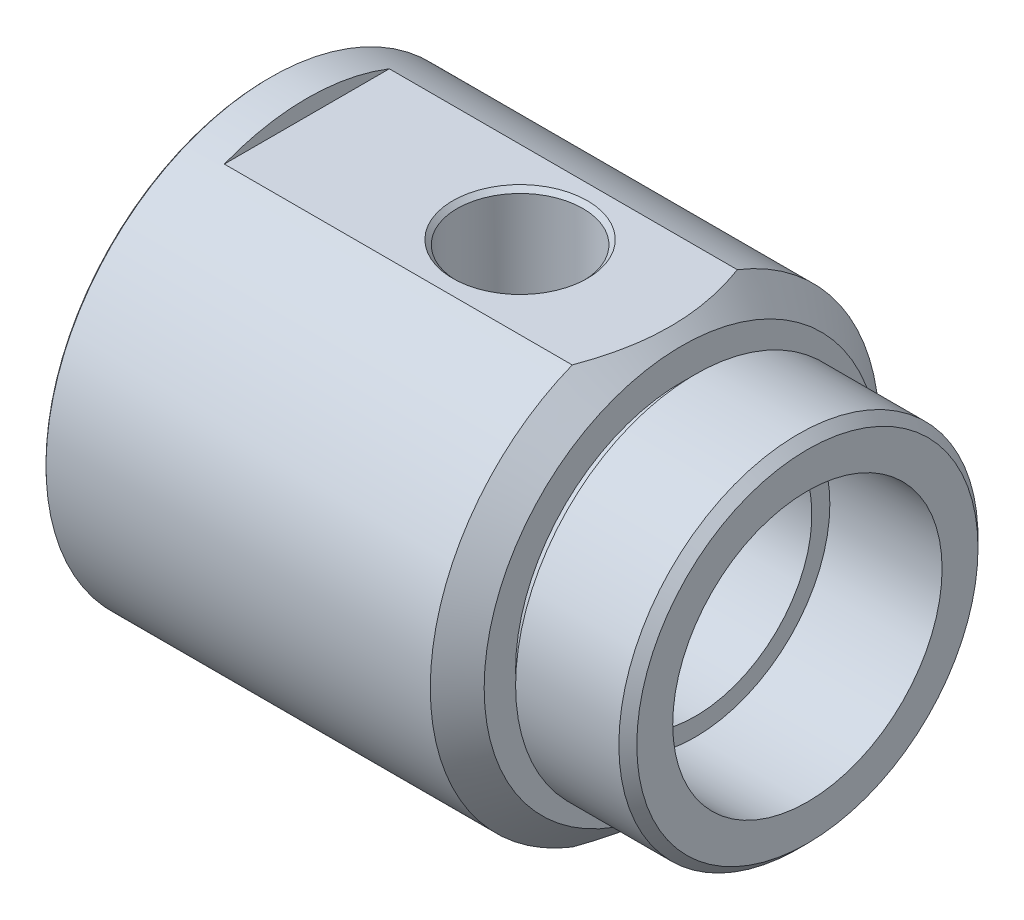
ISO-10303-21;
HEADER;
FILE_DESCRIPTION(('STEP AP214'),'2;1');
FILE_NAME('part.step','',(''),(''),'','','');
FILE_SCHEMA(('AUTOMOTIVE_DESIGN { 1 0 10303 214 1 1 1 1 }'));
ENDSEC;
DATA;
#1=APPLICATION_CONTEXT('core data for automotive mechanical design processes');
#2=APPLICATION_PROTOCOL_DEFINITION('international standard','automotive_design',2000,#1);
#3=PRODUCT_CONTEXT('',#1,'mechanical');
#4=PRODUCT('Part','Part','',(#3));
#5=PRODUCT_RELATED_PRODUCT_CATEGORY('part','',(#4));
#6=PRODUCT_DEFINITION_FORMATION('','',#4);
#7=PRODUCT_DEFINITION_CONTEXT('part definition',#1,'design');
#8=PRODUCT_DEFINITION('design','',#6,#7);
#9=PRODUCT_DEFINITION_SHAPE('','',#8);
#10=(LENGTH_UNIT() NAMED_UNIT(*) SI_UNIT(.MILLI.,.METRE.));
#11=(NAMED_UNIT(*) PLANE_ANGLE_UNIT() SI_UNIT($,.RADIAN.));
#12=(NAMED_UNIT(*) SI_UNIT($,.STERADIAN.) SOLID_ANGLE_UNIT());
#13=UNCERTAINTY_MEASURE_WITH_UNIT(LENGTH_MEASURE(1.E-05),#10,'distance_accuracy_value','');
#14=(GEOMETRIC_REPRESENTATION_CONTEXT(3) GLOBAL_UNCERTAINTY_ASSIGNED_CONTEXT((#13)) GLOBAL_UNIT_ASSIGNED_CONTEXT((#10,
#11,#12)) REPRESENTATION_CONTEXT('',''));
#15=CARTESIAN_POINT('',(0.,0.,0.));
#16=DIRECTION('',(0.,0.,1.));
#17=DIRECTION('',(1.,0.,0.));
#18=AXIS2_PLACEMENT_3D('',#15,#16,#17);
#19=CARTESIAN_POINT('',(0.,0.,0.));
#20=DIRECTION('',(-1.,0.,0.));
#21=DIRECTION('',(0.,0.,1.));
#22=AXIS2_PLACEMENT_3D('',#19,#20,#21);
#23=CYLINDRICAL_SURFACE('',#22,25.);
#24=CARTESIAN_POINT('',(0.199999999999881,0.,0.));
#25=DIRECTION('',(1.,0.,0.));
#26=DIRECTION('',(0.,0.,-1.));
#27=AXIS2_PLACEMENT_3D('',#24,#25,#26);
#28=CIRCLE('',#27,25.);
#29=CARTESIAN_POINT('',(0.199999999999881,0.,-25.));
#30=VERTEX_POINT('',#29);
#31=EDGE_CURVE('E45',#30,#30,#28,.T.);
#32=ORIENTED_EDGE('',*,*,#31,.T.);
#33=EDGE_LOOP('',(#32));
#34=FACE_BOUND('',#33,.T.);
#35=DIRECTION('',(-1.,0.,0.));
#36=VECTOR('',#35,1.);
#37=CARTESIAN_POINT('',(0.,-23.25,9.18898797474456));
#38=LINE('',#37,#36);
#39=CARTESIAN_POINT('',(42.9999999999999,-23.25,9.18898797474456));
#40=VERTEX_POINT('',#39);
#41=CARTESIAN_POINT('',(4.25,-23.25,9.18898797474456));
#42=VERTEX_POINT('',#41);
#43=EDGE_CURVE('E205',#40,#42,#38,.T.);
#44=ORIENTED_EDGE('',*,*,#43,.F.);
#45=CARTESIAN_POINT('',(42.9999999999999,0.,0.));
#46=DIRECTION('',(-1.,0.,0.));
#47=DIRECTION('',(0.,0.,1.));
#48=AXIS2_PLACEMENT_3D('',#45,#46,#47);
#49=CIRCLE('',#48,25.);
#50=CARTESIAN_POINT('',(42.9999999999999,23.25,9.18898797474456));
#51=VERTEX_POINT('',#50);
#52=EDGE_CURVE('E60',#40,#51,#49,.T.);
#53=ORIENTED_EDGE('',*,*,#52,.T.);
#54=DIRECTION('',(-1.,0.,0.));
#55=VECTOR('',#54,1.);
#56=CARTESIAN_POINT('',(0.,23.25,9.18898797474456));
#57=LINE('',#56,#55);
#58=CARTESIAN_POINT('',(4.25,23.25,9.18898797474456));
#59=VERTEX_POINT('',#58);
#60=EDGE_CURVE('E335',#51,#59,#57,.T.);
#61=ORIENTED_EDGE('',*,*,#60,.T.);
#62=CARTESIAN_POINT('',(4.25000000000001,0.,0.));
#63=DIRECTION('',(-1.,0.,0.));
#64=DIRECTION('',(0.,-1.,0.));
#65=AXIS2_PLACEMENT_3D('',#62,#63,#64);
#66=CIRCLE('',#65,25.);
#67=CARTESIAN_POINT('',(4.25,23.25,-9.18898797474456));
#68=VERTEX_POINT('',#67);
#69=EDGE_CURVE('E164',#59,#68,#66,.T.);
#70=ORIENTED_EDGE('',*,*,#69,.T.);
#71=DIRECTION('',(-1.,0.,0.));
#72=VECTOR('',#71,1.);
#73=CARTESIAN_POINT('',(0.,23.25,-9.18898797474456));
#74=LINE('',#73,#72);
#75=CARTESIAN_POINT('',(42.9999999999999,23.25,-9.18898797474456));
#76=VERTEX_POINT('',#75);
#77=EDGE_CURVE('E333',#68,#76,#74,.F.);
#78=ORIENTED_EDGE('',*,*,#77,.T.);
#79=CARTESIAN_POINT('',(42.9999999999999,-23.25,-9.18898797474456));
#80=VERTEX_POINT('',#79);
#81=EDGE_CURVE('E213',#76,#80,#49,.T.);
#82=ORIENTED_EDGE('',*,*,#81,.T.);
#83=DIRECTION('',(-1.,0.,0.));
#84=VECTOR('',#83,1.);
#85=CARTESIAN_POINT('',(0.,-23.25,-9.18898797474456));
#86=LINE('',#85,#84);
#87=CARTESIAN_POINT('',(4.25,-23.25,-9.18898797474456));
#88=VERTEX_POINT('',#87);
#89=EDGE_CURVE('E52',#88,#80,#86,.F.);
#90=ORIENTED_EDGE('',*,*,#89,.F.);
#91=CARTESIAN_POINT('',(4.25000000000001,0.,0.));
#92=DIRECTION('',(1.,0.,0.));
#93=DIRECTION('',(0.,1.,0.));
#94=AXIS2_PLACEMENT_3D('',#91,#92,#93);
#95=CIRCLE('',#94,25.);
#96=EDGE_CURVE('E163',#42,#88,#95,.T.);
#97=ORIENTED_EDGE('',*,*,#96,.F.);
#98=EDGE_LOOP('',(#44,#53,#61,#70,#78,#82,#90,#97));
#99=FACE_BOUND('',#98,.T.);
#100=ADVANCED_FACE('F38',(#34,#99),#23,.T.);
#101=CARTESIAN_POINT('',(42.9999999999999,0.,0.));
#102=DIRECTION('',(-1.,0.,0.));
#103=DIRECTION('',(0.,0.,1.));
#104=AXIS2_PLACEMENT_3D('',#101,#102,#103);
#105=CONICAL_SURFACE('',#104,25.,0.785398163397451);
#106=CARTESIAN_POINT('',(45.9999999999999,0.,0.));
#107=DIRECTION('',(-1.,0.,0.));
#108=DIRECTION('',(0.,0.,1.));
#109=AXIS2_PLACEMENT_3D('',#106,#107,#108);
#110=CIRCLE('',#109,22.);
#111=CARTESIAN_POINT('',(45.9999999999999,0.,22.));
#112=VERTEX_POINT('',#111);
#113=EDGE_CURVE('E216',#112,#112,#110,.F.);
#114=ORIENTED_EDGE('',*,*,#113,.F.);
#115=EDGE_LOOP('',(#114));
#116=FACE_BOUND('',#115,.T.);
#117=ORIENTED_EDGE('',*,*,#52,.F.);
#118=CARTESIAN_POINT('',(39.1715018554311,-23.25,-17.0446415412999));
#119=CARTESIAN_POINT('',(39.4225471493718,-23.25,-16.6199759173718));
#120=CARTESIAN_POINT('',(39.6691360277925,-23.25,-16.1926410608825));
#121=CARTESIAN_POINT('',(40.1520597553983,-23.25,-15.3320800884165));
#122=CARTESIAN_POINT('',(40.388391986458,-23.25,-14.898852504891));
#123=CARTESIAN_POINT('',(40.8502765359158,-23.25,-14.0243808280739));
#124=CARTESIAN_POINT('',(41.0757807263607,-23.25,-13.5831111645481));
#125=CARTESIAN_POINT('',(41.5132168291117,-23.25,-12.6939735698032));
#126=CARTESIAN_POINT('',(41.7251496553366,-23.25,-12.2461060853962));
#127=CARTESIAN_POINT('',(42.3449482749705,-23.25,-10.8761496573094));
#128=CARTESIAN_POINT('',(42.7287080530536,-23.25,-9.94276379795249));
#129=CARTESIAN_POINT('',(43.241660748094,-23.25,-8.5210051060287));
#130=CARTESIAN_POINT('',(43.4021101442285,-23.25,-8.04380089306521));
#131=CARTESIAN_POINT('',(43.6995767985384,-23.25,-7.08217080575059));
#132=CARTESIAN_POINT('',(43.8365978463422,-23.25,-6.59774611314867));
#133=CARTESIAN_POINT('',(44.1076801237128,-23.25,-5.5311491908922));
#134=CARTESIAN_POINT('',(44.2364169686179,-23.25,-4.94760636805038));
#135=CARTESIAN_POINT('',(44.4529427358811,-23.25,-3.77286868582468));
#136=CARTESIAN_POINT('',(44.5407296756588,-23.25,-3.1816734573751));
#137=CARTESIAN_POINT('',(44.6715120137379,-23.25,-1.99948035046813));
#138=CARTESIAN_POINT('',(44.7148879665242,-23.25,-1.4085249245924));
#139=CARTESIAN_POINT('',(44.7564302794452,-23.25,-0.224945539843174));
#140=CARTESIAN_POINT('',(44.7545956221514,-23.25,0.367678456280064));
#141=CARTESIAN_POINT('',(44.7160862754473,-23.25,1.30226166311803));
#142=CARTESIAN_POINT('',(44.6943760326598,-23.25,1.64490684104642));
#143=CARTESIAN_POINT('',(44.636132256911,-23.25,2.32893972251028));
#144=CARTESIAN_POINT('',(44.5995983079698,-23.25,2.67032739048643));
#145=CARTESIAN_POINT('',(44.4683973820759,-23.25,3.69177756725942));
#146=CARTESIAN_POINT('',(44.3521299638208,-23.25,4.36915863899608));
#147=CARTESIAN_POINT('',(44.0656926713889,-23.25,5.7211183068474));
#148=CARTESIAN_POINT('',(43.8948615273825,-23.25,6.39555383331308));
#149=CARTESIAN_POINT('',(43.5067897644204,-23.25,7.73064512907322));
#150=CARTESIAN_POINT('',(43.2895581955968,-23.25,8.39130355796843));
#151=CARTESIAN_POINT('',(42.7563639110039,-23.25,9.86200763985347));
#152=CARTESIAN_POINT('',(42.4293011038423,-23.25,10.668005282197));
#153=CARTESIAN_POINT('',(41.7260058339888,-23.25,12.2584466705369));
#154=CARTESIAN_POINT('',(41.3497479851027,-23.25,13.0428790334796));
#155=CARTESIAN_POINT('',(40.5570739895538,-23.25,14.5944492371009));
#156=CARTESIAN_POINT('',(40.1405234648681,-23.25,15.3615178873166));
#157=CARTESIAN_POINT('',(39.2765895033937,-23.25,16.8777920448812));
#158=CARTESIAN_POINT('',(38.8292114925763,-23.25,17.627000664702));
#159=CARTESIAN_POINT('',(37.9307971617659,-23.25,19.0762321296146));
#160=CARTESIAN_POINT('',(37.4808592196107,-23.25,19.776939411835));
#161=CARTESIAN_POINT('',(36.562704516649,-23.25,21.1663139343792));
#162=CARTESIAN_POINT('',(36.0944862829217,-23.25,21.8549801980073));
#163=CARTESIAN_POINT('',(35.1471080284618,-23.25,23.2160872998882));
#164=CARTESIAN_POINT('',(34.6680741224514,-23.25,23.8886161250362));
#165=CARTESIAN_POINT('',(33.9404318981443,-23.25,24.8906464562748));
#166=CARTESIAN_POINT('',(33.6964014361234,-23.25,25.2234867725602));
#167=CARTESIAN_POINT('',(33.2055447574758,-23.25,25.8870898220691));
#168=CARTESIAN_POINT('',(32.9587185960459,-23.25,26.2178525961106));
#169=CARTESIAN_POINT('',(32.7106167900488,-23.25,26.5476565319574));
#170=B_SPLINE_CURVE_WITH_KNOTS('',3,(#118,#119,#120,#121,#122,#123,#124,#125,#126,#127,#128,
#129,#130,#131,#132,#133,#134,#135,#136,#137,#138,#139,#140,#141,#142,#143,#144,#145,#146,#147,
#148,#149,#150,#151,#152,#153,#154,#155,#156,#157,#158,#159,#160,#161,#162,#163,#164,#165,#166,
#167,#168,#169),.UNSPECIFIED.,.F.,.F.,(4,2,2,2,2,2,2,2,2,2,2,2,2,2,2,2,2,2,2,2,2,2,2,2,2,4),(0.,
1.47997369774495,2.96032297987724,4.44673675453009,5.93305032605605,8.95689539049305,
10.4667855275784,11.9764312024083,13.7678066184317,15.5592687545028,17.3352481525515,
19.1112675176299,20.1409682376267,21.1706978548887,23.2300631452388,25.3153989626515,
27.4003284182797,30.00768224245,32.6163868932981,35.23411312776,37.8513797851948,
40.3492226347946,42.8472671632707,45.3241734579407,46.5623061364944,47.8004144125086),.UNSPECIFIED.);
#171=EDGE_CURVE('E156',#40,#80,#170,.F.);
#172=ORIENTED_EDGE('',*,*,#171,.T.);
#173=ORIENTED_EDGE('',*,*,#81,.F.);
#174=CARTESIAN_POINT('',(39.1715018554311,23.25,-17.0446415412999));
#175=CARTESIAN_POINT('',(39.4225471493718,23.25,-16.6199759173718));
#176=CARTESIAN_POINT('',(39.6691360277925,23.25,-16.1926410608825));
#177=CARTESIAN_POINT('',(40.1520597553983,23.25,-15.3320800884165));
#178=CARTESIAN_POINT('',(40.388391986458,23.25,-14.898852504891));
#179=CARTESIAN_POINT('',(40.8502765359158,23.25,-14.0243808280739));
#180=CARTESIAN_POINT('',(41.0757807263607,23.25,-13.5831111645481));
#181=CARTESIAN_POINT('',(41.5132168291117,23.25,-12.6939735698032));
#182=CARTESIAN_POINT('',(41.7251496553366,23.25,-12.2461060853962));
#183=CARTESIAN_POINT('',(42.3449482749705,23.25,-10.8761496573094));
#184=CARTESIAN_POINT('',(42.7287080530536,23.25,-9.94276379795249));
#185=CARTESIAN_POINT('',(43.241660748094,23.25,-8.5210051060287));
#186=CARTESIAN_POINT('',(43.4021101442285,23.25,-8.04380089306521));
#187=CARTESIAN_POINT('',(43.6995767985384,23.25,-7.08217080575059));
#188=CARTESIAN_POINT('',(43.8365978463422,23.25,-6.59774611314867));
#189=CARTESIAN_POINT('',(44.1076801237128,23.25,-5.5311491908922));
#190=CARTESIAN_POINT('',(44.2364169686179,23.25,-4.94760636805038));
#191=CARTESIAN_POINT('',(44.4529427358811,23.25,-3.77286868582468));
#192=CARTESIAN_POINT('',(44.5407296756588,23.25,-3.1816734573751));
#193=CARTESIAN_POINT('',(44.6715120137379,23.25,-1.99948035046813));
#194=CARTESIAN_POINT('',(44.7148879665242,23.25,-1.4085249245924));
#195=CARTESIAN_POINT('',(44.7564302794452,23.25,-0.224945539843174));
#196=CARTESIAN_POINT('',(44.7545956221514,23.25,0.367678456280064));
#197=CARTESIAN_POINT('',(44.7160862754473,23.25,1.30226166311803));
#198=CARTESIAN_POINT('',(44.6943760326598,23.25,1.64490684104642));
#199=CARTESIAN_POINT('',(44.636132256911,23.25,2.32893972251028));
#200=CARTESIAN_POINT('',(44.5995983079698,23.25,2.67032739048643));
#201=CARTESIAN_POINT('',(44.4683973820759,23.25,3.69177756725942));
#202=CARTESIAN_POINT('',(44.3521299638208,23.25,4.36915863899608));
#203=CARTESIAN_POINT('',(44.0656926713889,23.25,5.7211183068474));
#204=CARTESIAN_POINT('',(43.8948615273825,23.25,6.39555383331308));
#205=CARTESIAN_POINT('',(43.5067897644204,23.25,7.73064512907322));
#206=CARTESIAN_POINT('',(43.2895581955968,23.25,8.39130355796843));
#207=CARTESIAN_POINT('',(42.7563639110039,23.25,9.86200763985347));
#208=CARTESIAN_POINT('',(42.4293011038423,23.25,10.668005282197));
#209=CARTESIAN_POINT('',(41.7260058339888,23.25,12.2584466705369));
#210=CARTESIAN_POINT('',(41.3497479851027,23.25,13.0428790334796));
#211=CARTESIAN_POINT('',(40.5570739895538,23.25,14.5944492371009));
#212=CARTESIAN_POINT('',(40.1405234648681,23.25,15.3615178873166));
#213=CARTESIAN_POINT('',(39.2765895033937,23.25,16.8777920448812));
#214=CARTESIAN_POINT('',(38.8292114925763,23.25,17.627000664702));
#215=CARTESIAN_POINT('',(37.9307971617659,23.25,19.0762321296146));
#216=CARTESIAN_POINT('',(37.4808592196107,23.25,19.776939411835));
#217=CARTESIAN_POINT('',(36.562704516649,23.25,21.1663139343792));
#218=CARTESIAN_POINT('',(36.0944862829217,23.25,21.8549801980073));
#219=CARTESIAN_POINT('',(35.1471080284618,23.25,23.2160872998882));
#220=CARTESIAN_POINT('',(34.6680741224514,23.25,23.8886161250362));
#221=CARTESIAN_POINT('',(33.9404318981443,23.25,24.8906464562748));
#222=CARTESIAN_POINT('',(33.6964014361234,23.25,25.2234867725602));
#223=CARTESIAN_POINT('',(33.2055447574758,23.25,25.8870898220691));
#224=CARTESIAN_POINT('',(32.9587185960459,23.25,26.2178525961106));
#225=CARTESIAN_POINT('',(32.7106167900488,23.25,26.5476565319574));
#226=B_SPLINE_CURVE_WITH_KNOTS('',3,(#174,#175,#176,#177,#178,#179,#180,#181,#182,#183,#184,
#185,#186,#187,#188,#189,#190,#191,#192,#193,#194,#195,#196,#197,#198,#199,#200,#201,#202,#203,
#204,#205,#206,#207,#208,#209,#210,#211,#212,#213,#214,#215,#216,#217,#218,#219,#220,#221,#222,
#223,#224,#225),.UNSPECIFIED.,.F.,.F.,(4,2,2,2,2,2,2,2,2,2,2,2,2,2,2,2,2,2,2,2,2,2,2,2,2,4),(0.,
1.47997369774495,2.96032297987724,4.44673675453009,5.93305032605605,8.95689539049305,
10.4667855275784,11.9764312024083,13.7678066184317,15.5592687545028,17.3352481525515,
19.1112675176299,20.1409682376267,21.1706978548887,23.2300631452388,25.3153989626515,
27.4003284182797,30.00768224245,32.6163868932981,35.23411312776,37.8513797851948,
40.3492226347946,42.8472671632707,45.3241734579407,46.5623061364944,47.8004144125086),.UNSPECIFIED.);
#227=EDGE_CURVE('E179',#51,#76,#226,.F.);
#228=ORIENTED_EDGE('',*,*,#227,.F.);
#229=EDGE_LOOP('',(#117,#172,#173,#228));
#230=FACE_BOUND('',#229,.T.);
#231=ADVANCED_FACE('F167',(#116,#230),#105,.T.);
#232=CARTESIAN_POINT('',(0.,14.5,0.));
#233=DIRECTION('',(1.,0.,0.));
#234=DIRECTION('',(0.,0.,-1.));
#235=AXIS2_PLACEMENT_3D('',#232,#233,#234);
#236=PLANE('',#235);
#237=CARTESIAN_POINT('',(0.,15.2027957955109,15.2027957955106));
#238=DIRECTION('',(-1.,0.,0.));
#239=DIRECTION('',(0.,0.,1.));
#240=AXIS2_PLACEMENT_3D('',#237,#238,#239);
#241=CIRCLE('',#240,1.64999999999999);
#242=CARTESIAN_POINT('',(0.,15.2027957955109,16.8527957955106));
#243=VERTEX_POINT('',#242);
#244=EDGE_CURVE('E100',#243,#243,#241,.T.);
#245=ORIENTED_EDGE('',*,*,#244,.F.);
#246=EDGE_LOOP('',(#245));
#247=FACE_BOUND('',#246,.T.);
#248=CARTESIAN_POINT('',(0.,-15.2027957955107,15.2027957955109));
#249=DIRECTION('',(-1.,0.,0.));
#250=DIRECTION('',(0.,0.,1.));
#251=AXIS2_PLACEMENT_3D('',#248,#249,#250);
#252=CIRCLE('',#251,1.64999999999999);
#253=CARTESIAN_POINT('',(0.,-15.2027957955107,16.8527957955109));
#254=VERTEX_POINT('',#253);
#255=EDGE_CURVE('E108',#254,#254,#252,.T.);
#256=ORIENTED_EDGE('',*,*,#255,.F.);
#257=EDGE_LOOP('',(#256));
#258=FACE_BOUND('',#257,.T.);
#259=CARTESIAN_POINT('',(0.,-15.2027957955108,-15.2027957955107));
#260=DIRECTION('',(-1.,0.,0.));
#261=DIRECTION('',(0.,0.,1.));
#262=AXIS2_PLACEMENT_3D('',#259,#260,#261);
#263=CIRCLE('',#262,1.64999999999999);
#264=CARTESIAN_POINT('',(0.,-15.2027957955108,-13.5527957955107));
#265=VERTEX_POINT('',#264);
#266=EDGE_CURVE('E114',#265,#265,#263,.T.);
#267=ORIENTED_EDGE('',*,*,#266,.F.);
#268=EDGE_LOOP('',(#267));
#269=FACE_BOUND('',#268,.T.);
#270=CARTESIAN_POINT('',(0.,15.2027957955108,-15.2027957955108));
#271=DIRECTION('',(-1.,0.,0.));
#272=DIRECTION('',(0.,0.,1.));
#273=AXIS2_PLACEMENT_3D('',#270,#271,#272);
#274=CIRCLE('',#273,1.64999999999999);
#275=CARTESIAN_POINT('',(0.,15.2027957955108,-13.5527957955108));
#276=VERTEX_POINT('',#275);
#277=EDGE_CURVE('E120',#276,#276,#274,.T.);
#278=ORIENTED_EDGE('',*,*,#277,.F.);
#279=EDGE_LOOP('',(#278));
#280=FACE_BOUND('',#279,.T.);
#281=CARTESIAN_POINT('',(0.,0.,0.));
#282=DIRECTION('',(1.,0.,0.));
#283=DIRECTION('',(0.,0.,-1.));
#284=AXIS2_PLACEMENT_3D('',#281,#282,#283);
#285=CIRCLE('',#284,24.8000000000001);
#286=CARTESIAN_POINT('',(0.,0.,-24.8000000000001));
#287=VERTEX_POINT('',#286);
#288=EDGE_CURVE('E314',#287,#287,#285,.F.);
#289=ORIENTED_EDGE('',*,*,#288,.T.);
#290=EDGE_LOOP('',(#289));
#291=FACE_BOUND('',#290,.T.);
#292=CARTESIAN_POINT('',(0.,0.,0.));
#293=DIRECTION('',(1.,0.,0.));
#294=DIRECTION('',(0.,0.,-1.));
#295=AXIS2_PLACEMENT_3D('',#292,#293,#294);
#296=CIRCLE('',#295,14.7000000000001);
#297=CARTESIAN_POINT('',(0.,0.,-14.7000000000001));
#298=VERTEX_POINT('',#297);
#299=EDGE_CURVE('E306',#298,#298,#296,.T.);
#300=ORIENTED_EDGE('',*,*,#299,.T.);
#301=EDGE_LOOP('',(#300));
#302=FACE_BOUND('',#301,.T.);
#303=ADVANCED_FACE('F172',(#247,#258,#269,#280,#291,#302),#236,.F.);
#304=CARTESIAN_POINT('',(0.,0.,0.));
#305=DIRECTION('',(-1.,0.,0.));
#306=DIRECTION('',(0.,0.,1.));
#307=AXIS2_PLACEMENT_3D('',#304,#305,#306);
#308=CYLINDRICAL_SURFACE('',#307,14.5);
#309=CARTESIAN_POINT('',(0.199999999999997,0.,0.));
#310=DIRECTION('',(1.,0.,0.));
#311=DIRECTION('',(0.,0.,-1.));
#312=AXIS2_PLACEMENT_3D('',#309,#310,#311);
#313=CIRCLE('',#312,14.5);
#314=CARTESIAN_POINT('',(0.199999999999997,0.,-14.5));
#315=VERTEX_POINT('',#314);
#316=EDGE_CURVE('E11',#315,#315,#313,.F.);
#317=ORIENTED_EDGE('',*,*,#316,.T.);
#318=EDGE_LOOP('',(#317));
#319=FACE_BOUND('',#318,.T.);
#320=CARTESIAN_POINT('',(4.25,0.,0.));
#321=DIRECTION('',(-1.,0.,0.));
#322=DIRECTION('',(0.,0.,1.));
#323=AXIS2_PLACEMENT_3D('',#320,#321,#322);
#324=CIRCLE('',#323,14.5);
#325=CARTESIAN_POINT('',(4.25,0.,14.5));
#326=VERTEX_POINT('',#325);
#327=EDGE_CURVE('E214',#326,#326,#324,.T.);
#328=ORIENTED_EDGE('',*,*,#327,.F.);
#329=EDGE_LOOP('',(#328));
#330=FACE_BOUND('',#329,.T.);
#331=ADVANCED_FACE('F261',(#319,#330),#308,.F.);
#332=CARTESIAN_POINT('',(4.25,13.,0.));
#333=DIRECTION('',(1.,0.,0.));
#334=DIRECTION('',(0.,0.,-1.));
#335=AXIS2_PLACEMENT_3D('',#332,#333,#334);
#336=PLANE('',#335);
#337=CARTESIAN_POINT('',(4.25,0.,0.));
#338=DIRECTION('',(-1.,0.,0.));
#339=DIRECTION('',(0.,0.,1.));
#340=AXIS2_PLACEMENT_3D('',#337,#338,#339);
#341=CIRCLE('',#340,13.);
#342=CARTESIAN_POINT('',(4.25,0.,13.));
#343=VERTEX_POINT('',#342);
#344=EDGE_CURVE('E218',#343,#343,#341,.T.);
#345=ORIENTED_EDGE('',*,*,#344,.F.);
#346=EDGE_LOOP('',(#345));
#347=FACE_BOUND('',#346,.T.);
#348=ORIENTED_EDGE('',*,*,#327,.T.);
#349=EDGE_LOOP('',(#348));
#350=FACE_BOUND('',#349,.T.);
#351=ADVANCED_FACE('F258',(#347,#350),#336,.F.);
#352=CARTESIAN_POINT('',(0.,0.,0.));
#353=DIRECTION('',(-1.,0.,0.));
#354=DIRECTION('',(0.,0.,1.));
#355=AXIS2_PLACEMENT_3D('',#352,#353,#354);
#356=CYLINDRICAL_SURFACE('',#355,13.);
#357=CARTESIAN_POINT('',(28.,-10.9544511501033,7.));
#358=CARTESIAN_POINT('',(27.8198205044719,-10.9544497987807,7.00000106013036));
#359=CARTESIAN_POINT('',(27.6396530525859,-10.9589111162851,6.99303487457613));
#360=CARTESIAN_POINT('',(27.2807531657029,-10.9765743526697,6.96527724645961));
#361=CARTESIAN_POINT('',(27.1020212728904,-10.9897794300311,6.94448080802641));
#362=CARTESIAN_POINT('',(26.7472505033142,-11.0244348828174,6.88933168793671));
#363=CARTESIAN_POINT('',(26.5712153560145,-11.0458957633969,6.85496173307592));
#364=CARTESIAN_POINT('',(26.2232415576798,-11.0962700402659,6.7731156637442));
#365=CARTESIAN_POINT('',(26.0513047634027,-11.1251867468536,6.72563372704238));
#366=CARTESIAN_POINT('',(25.7137499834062,-11.1892650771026,6.61847508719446));
#367=CARTESIAN_POINT('',(25.5480982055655,-11.224384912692,6.55887960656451));
#368=CARTESIAN_POINT('',(25.2227508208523,-11.2999135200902,6.42788211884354));
#369=CARTESIAN_POINT('',(25.0630574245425,-11.3403242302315,6.35647578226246));
#370=CARTESIAN_POINT('',(24.5941086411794,-11.4677666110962,6.1254599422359));
#371=CARTESIAN_POINT('',(24.2947151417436,-11.5610627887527,5.94896699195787));
#372=CARTESIAN_POINT('',(23.6994550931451,-11.7647299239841,5.53614556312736));
#373=CARTESIAN_POINT('',(23.4067207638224,-11.8758797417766,5.29568488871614));
#374=CARTESIAN_POINT('',(22.9993494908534,-12.0412270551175,4.90196264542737));
#375=CARTESIAN_POINT('',(22.8687752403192,-12.0961474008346,4.76512011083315));
#376=CARTESIAN_POINT('',(22.6187765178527,-12.2042963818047,4.48087534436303));
#377=CARTESIAN_POINT('',(22.4993538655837,-12.2575247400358,4.33347139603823));
#378=CARTESIAN_POINT('',(22.2631557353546,-12.3652517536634,4.01632206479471));
#379=CARTESIAN_POINT('',(22.1473932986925,-12.4194990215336,3.84573526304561));
#380=CARTESIAN_POINT('',(21.9308330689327,-12.5230086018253,3.49397273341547));
#381=CARTESIAN_POINT('',(21.8300287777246,-12.5722730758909,3.31280165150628));
#382=CARTESIAN_POINT('',(21.6443794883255,-12.6644154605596,2.94096135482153));
#383=CARTESIAN_POINT('',(21.5595295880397,-12.7072953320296,2.75029508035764));
#384=CARTESIAN_POINT('',(21.4067847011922,-12.7853891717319,2.36077494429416));
#385=CARTESIAN_POINT('',(21.3388875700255,-12.820604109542,2.16192212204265));
#386=CARTESIAN_POINT('',(21.2257280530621,-12.879775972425,1.77390460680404));
#387=CARTESIAN_POINT('',(21.179085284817,-12.9044101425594,1.58524535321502));
#388=CARTESIAN_POINT('',(21.1015490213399,-12.9455607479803,1.20384140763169));
#389=CARTESIAN_POINT('',(21.0706547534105,-12.9620775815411,1.01109691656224));
#390=CARTESIAN_POINT('',(21.0250716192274,-12.986502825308,0.623276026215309));
#391=CARTESIAN_POINT('',(21.0103729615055,-12.9944164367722,0.428201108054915));
#392=CARTESIAN_POINT('',(20.9973699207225,-13.0014151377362,0.0373531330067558));
#393=CARTESIAN_POINT('',(20.9990643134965,-13.000500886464,-0.158419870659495));
#394=CARTESIAN_POINT('',(21.0178181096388,-12.9904124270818,-0.529190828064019));
#395=CARTESIAN_POINT('',(21.0333114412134,-12.9820801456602,-0.704293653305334));
#396=CARTESIAN_POINT('',(21.0773442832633,-12.9585035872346,-1.05244070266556));
#397=CARTESIAN_POINT('',(21.1058881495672,-12.943257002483,-1.22548421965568));
#398=CARTESIAN_POINT('',(21.1756824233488,-12.9062169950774,-1.56820403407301));
#399=CARTESIAN_POINT('',(21.2169283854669,-12.8844258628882,-1.73788148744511));
#400=CARTESIAN_POINT('',(21.3117034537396,-12.8347840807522,-2.07292418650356));
#401=CARTESIAN_POINT('',(21.3652373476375,-12.8069310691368,-2.23828772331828));
#402=CARTESIAN_POINT('',(21.4847268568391,-12.7454355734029,-2.56551933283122));
#403=CARTESIAN_POINT('',(21.5508148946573,-12.7117317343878,-2.72732750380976));
#404=CARTESIAN_POINT('',(21.6944278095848,-12.639477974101,-3.0446882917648));
#405=CARTESIAN_POINT('',(21.7719565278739,-12.6009264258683,-3.20023878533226));
#406=CARTESIAN_POINT('',(22.0207766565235,-12.4791856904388,-3.65632782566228));
#407=CARTESIAN_POINT('',(22.2083756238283,-12.3898714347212,-3.94650342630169));
#408=CARTESIAN_POINT('',(22.6440736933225,-12.1919818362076,-4.52305532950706));
#409=CARTESIAN_POINT('',(22.8964549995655,-12.0823688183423,-4.80583974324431));
#410=CARTESIAN_POINT('',(23.3062464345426,-11.9170351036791,-5.19657696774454));
#411=CARTESIAN_POINT('',(23.4481764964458,-11.8617256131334,-5.32133833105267));
#412=CARTESIAN_POINT('',(23.7419585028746,-11.7521203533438,-5.55920754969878));
#413=CARTESIAN_POINT('',(23.8938121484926,-11.6978247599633,-5.67231339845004));
#414=CARTESIAN_POINT('',(24.219648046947,-11.5873070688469,-5.89499977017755));
#415=CARTESIAN_POINT('',(24.3944231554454,-11.5312936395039,-6.003525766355));
#416=CARTESIAN_POINT('',(24.7538934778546,-11.4240012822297,-6.20525939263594));
#417=CARTESIAN_POINT('',(24.9385841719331,-11.3727202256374,-6.29847392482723));
#418=CARTESIAN_POINT('',(25.3168284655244,-11.2767893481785,-6.46866028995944));
#419=CARTESIAN_POINT('',(25.5103761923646,-11.2321352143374,-6.54564270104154));
#420=CARTESIAN_POINT('',(25.9051540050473,-11.1512819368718,-6.68245756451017));
#421=CARTESIAN_POINT('',(26.1063828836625,-11.1150814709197,-6.74229269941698));
#422=CARTESIAN_POINT('',(26.4983346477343,-11.0553419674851,-6.83976706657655));
#423=CARTESIAN_POINT('',(26.6885874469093,-11.0310146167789,-6.87881204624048));
#424=CARTESIAN_POINT('',(27.0726541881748,-10.9919742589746,-6.94102735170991));
#425=CARTESIAN_POINT('',(27.2664679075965,-10.9772606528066,-6.96419866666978));
#426=CARTESIAN_POINT('',(27.6556943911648,-10.9581384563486,-6.99424916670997));
#427=CARTESIAN_POINT('',(27.8511056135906,-10.9537208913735,-7.00114254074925));
#428=CARTESIAN_POINT('',(28.241764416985,-10.9553782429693,-6.99854942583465));
#429=CARTESIAN_POINT('',(28.4370120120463,-10.9614521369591,-6.98906453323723));
#430=CARTESIAN_POINT('',(28.7988283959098,-10.9822624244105,-6.95630765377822));
#431=CARTESIAN_POINT('',(28.9656648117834,-10.9956994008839,-6.93510038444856));
#432=CARTESIAN_POINT('',(29.2967241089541,-11.0297041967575,-6.88089021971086));
#433=CARTESIAN_POINT('',(29.4609461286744,-11.0502743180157,-6.84788351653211));
#434=CARTESIAN_POINT('',(29.7857052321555,-11.0978801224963,-6.77045907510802));
#435=CARTESIAN_POINT('',(29.9462425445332,-11.1249154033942,-6.72604204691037));
#436=CARTESIAN_POINT('',(30.2628202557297,-11.1846388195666,-6.62625327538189));
#437=CARTESIAN_POINT('',(30.4188588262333,-11.2173292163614,-6.57087714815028));
#438=CARTESIAN_POINT('',(30.8923869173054,-11.3255900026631,-6.38375884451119));
#439=CARTESIAN_POINT('',(31.2012813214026,-11.4091890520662,-6.23436868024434));
#440=CARTESIAN_POINT('',(31.7912725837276,-11.5885458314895,-5.89428294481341));
#441=CARTESIAN_POINT('',(32.0723552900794,-11.684309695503,-5.7035665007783));
#442=CARTESIAN_POINT('',(32.6434666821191,-11.8945829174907,-5.25257191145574));
#443=CARTESIAN_POINT('',(32.9284679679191,-12.0097434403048,-4.98614335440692));
#444=CARTESIAN_POINT('',(33.3205378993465,-12.177610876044,-4.55301425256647));
#445=CARTESIAN_POINT('',(33.4453921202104,-12.232788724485,-4.40294843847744));
#446=CARTESIAN_POINT('',(33.6826323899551,-12.3402234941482,-4.09217195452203));
#447=CARTESIAN_POINT('',(33.795016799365,-12.3924800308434,-3.93145988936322));
#448=CARTESIAN_POINT('',(34.011138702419,-12.4949724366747,-3.59281880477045));
#449=CARTESIAN_POINT('',(34.1142668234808,-12.5450141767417,-3.41444156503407));
#450=CARTESIAN_POINT('',(34.304899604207,-12.6390223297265,-3.04808930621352));
#451=CARTESIAN_POINT('',(34.3924116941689,-12.6829916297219,-2.86011890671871));
#452=CARTESIAN_POINT('',(34.5508118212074,-12.7635608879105,-2.47588756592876));
#453=CARTESIAN_POINT('',(34.6217090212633,-12.8001649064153,-2.27963126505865));
#454=CARTESIAN_POINT('',(34.745977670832,-12.8648900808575,-1.88029091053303));
#455=CARTESIAN_POINT('',(34.799351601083,-12.8930124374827,-1.67720782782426));
#456=CARTESIAN_POINT('',(34.8833543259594,-12.9375203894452,-1.28657310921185));
#457=CARTESIAN_POINT('',(34.9157221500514,-12.9547975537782,-1.09949553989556));
#458=CARTESIAN_POINT('',(34.9651771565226,-12.981265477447,-0.722765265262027));
#459=CARTESIAN_POINT('',(34.9822653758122,-12.9904567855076,-0.533112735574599));
#460=CARTESIAN_POINT('',(35.0009167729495,-13.0004913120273,-0.152902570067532));
#461=CARTESIAN_POINT('',(35.0024861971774,-13.0013378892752,0.0376546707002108));
#462=CARTESIAN_POINT('',(34.9900931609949,-12.9946671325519,0.418111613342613));
#463=CARTESIAN_POINT('',(34.9761313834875,-12.9871501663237,0.608011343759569));
#464=CARTESIAN_POINT('',(34.9346964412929,-12.9649427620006,0.969683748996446));
#465=CARTESIAN_POINT('',(34.908455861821,-12.9509074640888,1.14163993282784));
#466=CARTESIAN_POINT('',(34.8434032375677,-12.9163233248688,1.48254971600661));
#467=CARTESIAN_POINT('',(34.804586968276,-12.8957722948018,1.65150228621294));
#468=CARTESIAN_POINT('',(34.7148152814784,-12.8486297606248,1.98522190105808));
#469=CARTESIAN_POINT('',(34.6638636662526,-12.822040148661,2.14999023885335));
#470=CARTESIAN_POINT('',(34.5502939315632,-12.7633846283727,2.47451394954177));
#471=CARTESIAN_POINT('',(34.4876712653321,-12.7313165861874,2.63426734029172));
#472=CARTESIAN_POINT('',(34.3488398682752,-12.66112349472,2.95357840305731));
#473=CARTESIAN_POINT('',(34.2722206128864,-12.6228208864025,3.11291863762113));
#474=CARTESIAN_POINT('',(34.1076755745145,-12.5418732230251,3.42452508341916));
#475=CARTESIAN_POINT('',(34.0197459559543,-12.4992266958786,3.57678887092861));
#476=CARTESIAN_POINT('',(33.7399448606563,-12.3660802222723,4.0219145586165));
#477=CARTESIAN_POINT('',(33.5319895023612,-12.2703360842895,4.3032741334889));
#478=CARTESIAN_POINT('',(33.0524847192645,-12.0613422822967,4.86026390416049));
#479=CARTESIAN_POINT('',(32.7764242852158,-11.9473323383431,5.13173486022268));
#480=CARTESIAN_POINT('',(32.3312551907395,-11.7788334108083,5.5025127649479));
#481=CARTESIAN_POINT('',(32.1775279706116,-11.7230356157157,5.62012653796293));
#482=CARTESIAN_POINT('',(31.8602323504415,-11.6137506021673,5.84261349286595));
#483=CARTESIAN_POINT('',(31.6966623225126,-11.5602637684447,5.94748455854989));
#484=CARTESIAN_POINT('',(31.3506625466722,-11.4541817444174,6.1494299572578));
#485=CARTESIAN_POINT('',(31.1676892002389,-11.4018190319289,6.24569695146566));
#486=CARTESIAN_POINT('',(30.7926278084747,-11.3033649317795,6.42216084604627));
#487=CARTESIAN_POINT('',(30.6005444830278,-11.2572703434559,6.50236595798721));
#488=CARTESIAN_POINT('',(30.2088817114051,-11.1733020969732,6.64561563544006));
#489=CARTESIAN_POINT('',(30.0093220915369,-11.1354082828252,6.70870237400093));
#490=CARTESIAN_POINT('',(29.6039321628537,-11.0694471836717,6.8169914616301));
#491=CARTESIAN_POINT('',(29.3981060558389,-11.0413734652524,6.86220552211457));
#492=CARTESIAN_POINT('',(28.9943838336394,-10.9977702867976,6.93185656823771));
#493=CARTESIAN_POINT('',(28.79674316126,-10.9815946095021,6.95736841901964));
#494=CARTESIAN_POINT('',(28.3993967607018,-10.9599356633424,6.99143974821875));
#495=CARTESIAN_POINT('',(28.1996909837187,-10.9544526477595,6.999998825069));
#496=CARTESIAN_POINT('',(28.,-10.9544511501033,7.));
#497=B_SPLINE_CURVE_WITH_KNOTS('',3,(#357,#358,#359,#360,#361,#362,#363,#364,#365,#366,#367,
#368,#369,#370,#371,#372,#373,#374,#375,#376,#377,#378,#379,#380,#381,#382,#383,#384,#385,#386,
#387,#388,#389,#390,#391,#392,#393,#394,#395,#396,#397,#398,#399,#400,#401,#402,#403,#404,#405,
#406,#407,#408,#409,#410,#411,#412,#413,#414,#415,#416,#417,#418,#419,#420,#421,#422,#423,#424,
#425,#426,#427,#428,#429,#430,#431,#432,#433,#434,#435,#436,#437,#438,#439,#440,#441,#442,#443,
#444,#445,#446,#447,#448,#449,#450,#451,#452,#453,#454,#455,#456,#457,#458,#459,#460,#461,#462,
#463,#464,#465,#466,#467,#468,#469,#470,#471,#472,#473,#474,#475,#476,#477,#478,#479,#480,#481,
#482,#483,#484,#485,#486,#487,#488,#489,#490,#491,#492,#493,#494,#495,#496),.UNSPECIFIED.,.T.,
.F.,(4,2,2,2,2,2,2,2,2,2,2,2,2,2,2,2,2,2,2,2,2,2,2,2,2,2,2,2,2,2,2,2,2,2,2,2,2,2,2,2,2,2,2,2,2,
2,2,2,2,2,2,2,2,2,2,2,2,2,2,2,2,2,2,2,2,2,2,2,2,4),(0.,0.540330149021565,1.08085558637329,
1.62207110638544,2.16352733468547,2.70146619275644,3.23960268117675,4.315020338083,
5.49428316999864,6.08465846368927,6.67512992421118,7.31383315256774,7.95225809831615,
8.5904865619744,9.22863424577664,9.81550497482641,10.4023469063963,10.9888338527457,
11.5752770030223,12.1026043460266,12.6301078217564,13.1574268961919,13.684951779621,
14.2183856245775,14.7519989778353,15.8185841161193,16.9970581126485,17.5872671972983,
18.1775777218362,18.816425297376,19.454984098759,20.0931254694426,20.7311669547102,
21.3175037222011,21.9038039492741,22.4895929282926,23.0753248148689,23.5808878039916,
24.0866140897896,24.5923089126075,25.0982064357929,26.1532222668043,27.2087722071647,
28.4232824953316,29.0313282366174,29.6394538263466,30.2747073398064,30.9096577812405,
31.5442572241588,32.178766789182,32.7499170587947,33.3210285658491,33.8919101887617,
34.4627667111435,34.9857031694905,35.5088154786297,36.0317640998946,36.5549168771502,
37.0970524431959,37.6393723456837,38.7234712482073,39.9288026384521,40.532594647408,
41.1364867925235,41.7754754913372,42.4141366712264,43.0512098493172,43.6878648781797,
44.2866927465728,44.8855347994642),.UNSPECIFIED.);
#498=CARTESIAN_POINT('',(28.,-10.9544511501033,7.));
#499=VERTEX_POINT('',#498);
#500=EDGE_CURVE('E130',#499,#499,#497,.T.);
#501=ORIENTED_EDGE('',*,*,#500,.T.);
#502=EDGE_LOOP('',(#501));
#503=FACE_BOUND('',#502,.T.);
#504=CARTESIAN_POINT('',(28.,10.9544511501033,7.));
#505=CARTESIAN_POINT('',(28.1801794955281,10.9544497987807,7.00000106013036));
#506=CARTESIAN_POINT('',(28.3603469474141,10.9589111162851,6.99303487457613));
#507=CARTESIAN_POINT('',(28.7192468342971,10.9765743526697,6.96527724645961));
#508=CARTESIAN_POINT('',(28.8979787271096,10.9897794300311,6.94448080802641));
#509=CARTESIAN_POINT('',(29.2527494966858,11.0244348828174,6.88933168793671));
#510=CARTESIAN_POINT('',(29.4287846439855,11.0458957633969,6.85496173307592));
#511=CARTESIAN_POINT('',(29.7767584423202,11.0962700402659,6.7731156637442));
#512=CARTESIAN_POINT('',(29.9486952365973,11.1251867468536,6.72563372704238));
#513=CARTESIAN_POINT('',(30.2862500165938,11.1892650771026,6.61847508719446));
#514=CARTESIAN_POINT('',(30.4519017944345,11.224384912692,6.55887960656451));
#515=CARTESIAN_POINT('',(30.7772491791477,11.2999135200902,6.42788211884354));
#516=CARTESIAN_POINT('',(30.9369425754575,11.3403242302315,6.35647578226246));
#517=CARTESIAN_POINT('',(31.4058913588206,11.4677666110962,6.1254599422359));
#518=CARTESIAN_POINT('',(31.7052848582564,11.5610627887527,5.94896699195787));
#519=CARTESIAN_POINT('',(32.3005449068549,11.7647299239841,5.53614556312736));
#520=CARTESIAN_POINT('',(32.5932792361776,11.8758797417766,5.29568488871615));
#521=CARTESIAN_POINT('',(33.0006505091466,12.0412270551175,4.90196264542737));
#522=CARTESIAN_POINT('',(33.1312247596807,12.0961474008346,4.76512011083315));
#523=CARTESIAN_POINT('',(33.3812234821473,12.2042963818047,4.48087534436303));
#524=CARTESIAN_POINT('',(33.5006461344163,12.2575247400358,4.33347139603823));
#525=CARTESIAN_POINT('',(33.7368442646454,12.3652517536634,4.01632206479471));
#526=CARTESIAN_POINT('',(33.8526067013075,12.4194990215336,3.84573526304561));
#527=CARTESIAN_POINT('',(34.0691669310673,12.5230086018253,3.49397273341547));
#528=CARTESIAN_POINT('',(34.1699712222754,12.5722730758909,3.31280165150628));
#529=CARTESIAN_POINT('',(34.3556205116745,12.6644154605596,2.94096135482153));
#530=CARTESIAN_POINT('',(34.4404704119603,12.7072953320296,2.75029508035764));
#531=CARTESIAN_POINT('',(34.5932152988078,12.7853891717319,2.36077494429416));
#532=CARTESIAN_POINT('',(34.6611124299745,12.820604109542,2.16192212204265));
#533=CARTESIAN_POINT('',(34.7742719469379,12.879775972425,1.77390460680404));
#534=CARTESIAN_POINT('',(34.820914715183,12.9044101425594,1.58524535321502));
#535=CARTESIAN_POINT('',(34.8984509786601,12.9455607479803,1.20384140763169));
#536=CARTESIAN_POINT('',(34.9293452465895,12.9620775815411,1.01109691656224));
#537=CARTESIAN_POINT('',(34.9749283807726,12.986502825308,0.623276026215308));
#538=CARTESIAN_POINT('',(34.9896270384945,12.9944164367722,0.428201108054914));
#539=CARTESIAN_POINT('',(35.0026300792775,13.0014151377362,0.0373531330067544));
#540=CARTESIAN_POINT('',(35.0009356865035,13.000500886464,-0.158419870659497));
#541=CARTESIAN_POINT('',(34.9821818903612,12.9904124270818,-0.529190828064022));
#542=CARTESIAN_POINT('',(34.9666885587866,12.9820801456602,-0.704293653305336));
#543=CARTESIAN_POINT('',(34.9226557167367,12.9585035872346,-1.05244070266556));
#544=CARTESIAN_POINT('',(34.8941118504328,12.943257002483,-1.22548421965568));
#545=CARTESIAN_POINT('',(34.8243175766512,12.9062169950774,-1.56820403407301));
#546=CARTESIAN_POINT('',(34.7830716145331,12.8844258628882,-1.73788148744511));
#547=CARTESIAN_POINT('',(34.6882965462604,12.8347840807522,-2.07292418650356));
#548=CARTESIAN_POINT('',(34.6347626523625,12.8069310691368,-2.23828772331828));
#549=CARTESIAN_POINT('',(34.5152731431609,12.7454355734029,-2.56551933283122));
#550=CARTESIAN_POINT('',(34.4491851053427,12.7117317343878,-2.72732750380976));
#551=CARTESIAN_POINT('',(34.3055721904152,12.639477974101,-3.0446882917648));
#552=CARTESIAN_POINT('',(34.2280434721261,12.6009264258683,-3.20023878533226));
#553=CARTESIAN_POINT('',(33.9792233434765,12.4791856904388,-3.65632782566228));
#554=CARTESIAN_POINT('',(33.7916243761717,12.3898714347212,-3.94650342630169));
#555=CARTESIAN_POINT('',(33.3559263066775,12.1919818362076,-4.52305532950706));
#556=CARTESIAN_POINT('',(33.1035450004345,12.0823688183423,-4.80583974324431));
#557=CARTESIAN_POINT('',(32.6937535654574,11.9170351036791,-5.19657696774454));
#558=CARTESIAN_POINT('',(32.5518235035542,11.8617256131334,-5.32133833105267));
#559=CARTESIAN_POINT('',(32.2580414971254,11.7521203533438,-5.55920754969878));
#560=CARTESIAN_POINT('',(32.1061878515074,11.6978247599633,-5.67231339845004));
#561=CARTESIAN_POINT('',(31.780351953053,11.5873070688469,-5.89499977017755));
#562=CARTESIAN_POINT('',(31.6055768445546,11.5312936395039,-6.003525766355));
#563=CARTESIAN_POINT('',(31.2461065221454,11.4240012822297,-6.20525939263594));
#564=CARTESIAN_POINT('',(31.0614158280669,11.3727202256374,-6.29847392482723));
#565=CARTESIAN_POINT('',(30.6831715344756,11.2767893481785,-6.46866028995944));
#566=CARTESIAN_POINT('',(30.4896238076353,11.2321352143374,-6.54564270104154));
#567=CARTESIAN_POINT('',(30.0948459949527,11.1512819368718,-6.68245756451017));
#568=CARTESIAN_POINT('',(29.8936171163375,11.1150814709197,-6.74229269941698));
#569=CARTESIAN_POINT('',(29.5016653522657,11.0553419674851,-6.83976706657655));
#570=CARTESIAN_POINT('',(29.3114125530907,11.0310146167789,-6.87881204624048));
#571=CARTESIAN_POINT('',(28.9273458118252,10.9919742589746,-6.94102735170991));
#572=CARTESIAN_POINT('',(28.7335320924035,10.9772606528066,-6.96419866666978));
#573=CARTESIAN_POINT('',(28.3443056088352,10.9581384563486,-6.99424916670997));
#574=CARTESIAN_POINT('',(28.1488943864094,10.9537208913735,-7.00114254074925));
#575=CARTESIAN_POINT('',(27.758235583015,10.9553782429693,-6.99854942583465));
#576=CARTESIAN_POINT('',(27.5629879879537,10.9614521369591,-6.98906453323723));
#577=CARTESIAN_POINT('',(27.2011716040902,10.9822624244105,-6.95630765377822));
#578=CARTESIAN_POINT('',(27.0343351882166,10.9956994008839,-6.93510038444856));
#579=CARTESIAN_POINT('',(26.703275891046,11.0297041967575,-6.88089021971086));
#580=CARTESIAN_POINT('',(26.5390538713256,11.0502743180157,-6.84788351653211));
#581=CARTESIAN_POINT('',(26.2142947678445,11.0978801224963,-6.77045907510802));
#582=CARTESIAN_POINT('',(26.0537574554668,11.1249154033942,-6.72604204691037));
#583=CARTESIAN_POINT('',(25.7371797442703,11.1846388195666,-6.62625327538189));
#584=CARTESIAN_POINT('',(25.5811411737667,11.2173292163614,-6.57087714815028));
#585=CARTESIAN_POINT('',(25.1076130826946,11.3255900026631,-6.38375884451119));
#586=CARTESIAN_POINT('',(24.7987186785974,11.4091890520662,-6.23436868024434));
#587=CARTESIAN_POINT('',(24.2087274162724,11.5885458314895,-5.89428294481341));
#588=CARTESIAN_POINT('',(23.9276447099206,11.684309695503,-5.7035665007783));
#589=CARTESIAN_POINT('',(23.3565333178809,11.8945829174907,-5.25257191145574));
#590=CARTESIAN_POINT('',(23.0715320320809,12.0097434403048,-4.98614335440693));
#591=CARTESIAN_POINT('',(22.6794621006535,12.177610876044,-4.55301425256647));
#592=CARTESIAN_POINT('',(22.5546078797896,12.232788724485,-4.40294843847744));
#593=CARTESIAN_POINT('',(22.3173676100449,12.3402234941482,-4.09217195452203));
#594=CARTESIAN_POINT('',(22.204983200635,12.3924800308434,-3.93145988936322));
#595=CARTESIAN_POINT('',(21.988861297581,12.4949724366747,-3.59281880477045));
#596=CARTESIAN_POINT('',(21.8857331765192,12.5450141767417,-3.41444156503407));
#597=CARTESIAN_POINT('',(21.695100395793,12.6390223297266,-3.04808930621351));
#598=CARTESIAN_POINT('',(21.607588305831,12.6829916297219,-2.8601189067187));
#599=CARTESIAN_POINT('',(21.4491881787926,12.7635608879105,-2.47588756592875));
#600=CARTESIAN_POINT('',(21.3782909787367,12.8001649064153,-2.27963126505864));
#601=CARTESIAN_POINT('',(21.254022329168,12.8648900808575,-1.88029091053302));
#602=CARTESIAN_POINT('',(21.200648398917,12.8930124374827,-1.67720782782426));
#603=CARTESIAN_POINT('',(21.1166456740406,12.9375203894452,-1.28657310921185));
#604=CARTESIAN_POINT('',(21.0842778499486,12.9547975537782,-1.09949553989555));
#605=CARTESIAN_POINT('',(21.0348228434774,12.981265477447,-0.722765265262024));
#606=CARTESIAN_POINT('',(21.0177346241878,12.9904567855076,-0.533112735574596));
#607=CARTESIAN_POINT('',(20.9990832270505,13.0004913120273,-0.152902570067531));
#608=CARTESIAN_POINT('',(20.9975138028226,13.0013378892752,0.0376546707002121));
#609=CARTESIAN_POINT('',(21.0099068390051,12.9946671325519,0.418111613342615));
#610=CARTESIAN_POINT('',(21.0238686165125,12.9871501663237,0.608011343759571));
#611=CARTESIAN_POINT('',(21.0653035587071,12.9649427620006,0.969683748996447));
#612=CARTESIAN_POINT('',(21.091544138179,12.9509074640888,1.14163993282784));
#613=CARTESIAN_POINT('',(21.1565967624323,12.9163233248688,1.48254971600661));
#614=CARTESIAN_POINT('',(21.195413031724,12.8957722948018,1.65150228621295));
#615=CARTESIAN_POINT('',(21.2851847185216,12.8486297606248,1.98522190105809));
#616=CARTESIAN_POINT('',(21.3361363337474,12.822040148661,2.14999023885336));
#617=CARTESIAN_POINT('',(21.4497060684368,12.7633846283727,2.47451394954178));
#618=CARTESIAN_POINT('',(21.5123287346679,12.7313165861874,2.63426734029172));
#619=CARTESIAN_POINT('',(21.6511601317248,12.66112349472,2.95357840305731));
#620=CARTESIAN_POINT('',(21.7277793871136,12.6228208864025,3.11291863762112));
#621=CARTESIAN_POINT('',(21.8923244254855,12.5418732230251,3.42452508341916));
#622=CARTESIAN_POINT('',(21.9802540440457,12.4992266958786,3.57678887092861));
#623=CARTESIAN_POINT('',(22.2600551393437,12.3660802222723,4.0219145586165));
#624=CARTESIAN_POINT('',(22.4680104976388,12.2703360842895,4.3032741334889));
#625=CARTESIAN_POINT('',(22.9475152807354,12.0613422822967,4.8602639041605));
#626=CARTESIAN_POINT('',(23.2235757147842,11.9473323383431,5.13173486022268));
#627=CARTESIAN_POINT('',(23.6687448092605,11.7788334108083,5.5025127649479));
#628=CARTESIAN_POINT('',(23.8224720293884,11.7230356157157,5.62012653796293));
#629=CARTESIAN_POINT('',(24.1397676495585,11.6137506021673,5.84261349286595));
#630=CARTESIAN_POINT('',(24.3033376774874,11.5602637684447,5.94748455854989));
#631=CARTESIAN_POINT('',(24.6493374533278,11.4541817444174,6.1494299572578));
#632=CARTESIAN_POINT('',(24.8323107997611,11.4018190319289,6.24569695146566));
#633=CARTESIAN_POINT('',(25.2073721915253,11.3033649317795,6.42216084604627));
#634=CARTESIAN_POINT('',(25.3994555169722,11.2572703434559,6.50236595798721));
#635=CARTESIAN_POINT('',(25.7911182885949,11.1733020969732,6.64561563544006));
#636=CARTESIAN_POINT('',(25.9906779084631,11.1354082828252,6.70870237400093));
#637=CARTESIAN_POINT('',(26.3960678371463,11.0694471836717,6.8169914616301));
#638=CARTESIAN_POINT('',(26.6018939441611,11.0413734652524,6.86220552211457));
#639=CARTESIAN_POINT('',(27.0056161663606,10.9977702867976,6.93185656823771));
#640=CARTESIAN_POINT('',(27.20325683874,10.9815946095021,6.95736841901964));
#641=CARTESIAN_POINT('',(27.6006032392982,10.9599356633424,6.99143974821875));
#642=CARTESIAN_POINT('',(27.8003090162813,10.9544526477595,6.999998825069));
#643=CARTESIAN_POINT('',(28.,10.9544511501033,7.));
#644=B_SPLINE_CURVE_WITH_KNOTS('',3,(#504,#505,#506,#507,#508,#509,#510,#511,#512,#513,#514,
#515,#516,#517,#518,#519,#520,#521,#522,#523,#524,#525,#526,#527,#528,#529,#530,#531,#532,#533,
#534,#535,#536,#537,#538,#539,#540,#541,#542,#543,#544,#545,#546,#547,#548,#549,#550,#551,#552,
#553,#554,#555,#556,#557,#558,#559,#560,#561,#562,#563,#564,#565,#566,#567,#568,#569,#570,#571,
#572,#573,#574,#575,#576,#577,#578,#579,#580,#581,#582,#583,#584,#585,#586,#587,#588,#589,#590,
#591,#592,#593,#594,#595,#596,#597,#598,#599,#600,#601,#602,#603,#604,#605,#606,#607,#608,#609,
#610,#611,#612,#613,#614,#615,#616,#617,#618,#619,#620,#621,#622,#623,#624,#625,#626,#627,#628,
#629,#630,#631,#632,#633,#634,#635,#636,#637,#638,#639,#640,#641,#642,#643),.UNSPECIFIED.,.T.,
.F.,(4,2,2,2,2,2,2,2,2,2,2,2,2,2,2,2,2,2,2,2,2,2,2,2,2,2,2,2,2,2,2,2,2,2,2,2,2,2,2,2,2,2,2,2,2,
2,2,2,2,2,2,2,2,2,2,2,2,2,2,2,2,2,2,2,2,2,2,2,2,4),(0.,0.540330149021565,1.08085558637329,
1.62207110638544,2.16352733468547,2.70146619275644,3.23960268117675,4.31502033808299,
5.49428316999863,6.08465846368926,6.67512992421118,7.31383315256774,7.95225809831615,
8.5904865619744,9.22863424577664,9.81550497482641,10.4023469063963,10.9888338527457,
11.5752770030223,12.1026043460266,12.6301078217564,13.1574268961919,13.684951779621,
14.2183856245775,14.7519989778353,15.8185841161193,16.9970581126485,17.5872671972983,
18.1775777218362,18.816425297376,19.454984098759,20.0931254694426,20.7311669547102,
21.3175037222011,21.9038039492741,22.4895929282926,23.0753248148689,23.5808878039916,
24.0866140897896,24.5923089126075,25.0982064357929,26.1532222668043,27.2087722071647,
28.4232824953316,29.0313282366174,29.6394538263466,30.2747073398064,30.9096577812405,
31.5442572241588,32.178766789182,32.7499170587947,33.3210285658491,33.8919101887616,
34.4627667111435,34.9857031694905,35.5088154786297,36.0317640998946,36.5549168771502,
37.0970524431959,37.6393723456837,38.7234712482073,39.9288026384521,40.532594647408,
41.1364867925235,41.7754754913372,42.4141366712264,43.0512098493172,43.6878648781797,
44.2866927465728,44.8855347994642),.UNSPECIFIED.);
#645=CARTESIAN_POINT('',(28.,10.9544511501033,7.));
#646=VERTEX_POINT('',#645);
#647=EDGE_CURVE('E123',#646,#646,#644,.T.);
#648=ORIENTED_EDGE('',*,*,#647,.T.);
#649=EDGE_LOOP('',(#648));
#650=FACE_BOUND('',#649,.T.);
#651=CARTESIAN_POINT('',(47.5,0.,0.));
#652=DIRECTION('',(-1.,0.,0.));
#653=DIRECTION('',(0.,0.,1.));
#654=AXIS2_PLACEMENT_3D('',#651,#652,#653);
#655=CIRCLE('',#654,13.);
#656=CARTESIAN_POINT('',(47.5,0.,13.));
#657=VERTEX_POINT('',#656);
#658=EDGE_CURVE('E246',#657,#657,#655,.T.);
#659=ORIENTED_EDGE('',*,*,#658,.F.);
#660=EDGE_LOOP('',(#659));
#661=FACE_BOUND('',#660,.T.);
#662=ORIENTED_EDGE('',*,*,#344,.T.);
#663=EDGE_LOOP('',(#662));
#664=FACE_BOUND('',#663,.T.);
#665=ADVANCED_FACE('F134',(#503,#650,#661,#664),#356,.F.);
#666=CARTESIAN_POINT('',(47.4999999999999,15.,0.));
#667=DIRECTION('',(-1.,0.,0.));
#668=DIRECTION('',(0.,0.,1.));
#669=AXIS2_PLACEMENT_3D('',#666,#667,#668);
#670=PLANE('',#669);
#671=CARTESIAN_POINT('',(47.4999999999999,0.,0.));
#672=DIRECTION('',(-1.,0.,0.));
#673=DIRECTION('',(0.,0.,1.));
#674=AXIS2_PLACEMENT_3D('',#671,#672,#673);
#675=CIRCLE('',#674,15.);
#676=CARTESIAN_POINT('',(47.4999999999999,0.,15.));
#677=VERTEX_POINT('',#676);
#678=EDGE_CURVE('E241',#677,#677,#675,.T.);
#679=ORIENTED_EDGE('',*,*,#678,.F.);
#680=EDGE_LOOP('',(#679));
#681=FACE_BOUND('',#680,.T.);
#682=ORIENTED_EDGE('',*,*,#658,.T.);
#683=EDGE_LOOP('',(#682));
#684=FACE_BOUND('',#683,.T.);
#685=ADVANCED_FACE('F357',(#681,#684),#670,.F.);
#686=CARTESIAN_POINT('',(0.,0.,0.));
#687=DIRECTION('',(-1.,0.,0.));
#688=DIRECTION('',(0.,0.,1.));
#689=AXIS2_PLACEMENT_3D('',#686,#687,#688);
#690=CYLINDRICAL_SURFACE('',#689,15.);
#691=CARTESIAN_POINT('',(59.9999999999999,0.,0.));
#692=DIRECTION('',(-1.,0.,0.));
#693=DIRECTION('',(0.,0.,1.));
#694=AXIS2_PLACEMENT_3D('',#691,#692,#693);
#695=CIRCLE('',#694,15.);
#696=CARTESIAN_POINT('',(59.9999999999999,0.,15.));
#697=VERTEX_POINT('',#696);
#698=EDGE_CURVE('E239',#697,#697,#695,.T.);
#699=ORIENTED_EDGE('',*,*,#698,.F.);
#700=EDGE_LOOP('',(#699));
#701=FACE_BOUND('',#700,.T.);
#702=ORIENTED_EDGE('',*,*,#678,.T.);
#703=EDGE_LOOP('',(#702));
#704=FACE_BOUND('',#703,.T.);
#705=ADVANCED_FACE('F235',(#701,#704),#690,.F.);
#706=CARTESIAN_POINT('',(59.9999999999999,20.,0.));
#707=DIRECTION('',(-1.,0.,0.));
#708=DIRECTION('',(0.,0.,1.));
#709=AXIS2_PLACEMENT_3D('',#706,#707,#708);
#710=PLANE('',#709);
#711=CARTESIAN_POINT('',(59.9999999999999,0.,0.));
#712=DIRECTION('',(-1.,0.,0.));
#713=DIRECTION('',(0.,0.,1.));
#714=AXIS2_PLACEMENT_3D('',#711,#712,#713);
#715=CIRCLE('',#714,19.0000000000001);
#716=CARTESIAN_POINT('',(59.9999999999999,0.,19.0000000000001));
#717=VERTEX_POINT('',#716);
#718=EDGE_CURVE('E184',#717,#717,#715,.F.);
#719=ORIENTED_EDGE('',*,*,#718,.T.);
#720=EDGE_LOOP('',(#719));
#721=FACE_BOUND('',#720,.T.);
#722=ORIENTED_EDGE('',*,*,#698,.T.);
#723=EDGE_LOOP('',(#722));
#724=FACE_BOUND('',#723,.T.);
#725=ADVANCED_FACE('F230',(#721,#724),#710,.F.);
#726=CARTESIAN_POINT('',(0.,0.,0.));
#727=DIRECTION('',(-1.,0.,0.));
#728=DIRECTION('',(0.,0.,1.));
#729=AXIS2_PLACEMENT_3D('',#726,#727,#728);
#730=CYLINDRICAL_SURFACE('',#729,20.);
#731=CARTESIAN_POINT('',(59.,0.,0.));
#732=DIRECTION('',(-1.,0.,0.));
#733=DIRECTION('',(0.,0.,1.));
#734=AXIS2_PLACEMENT_3D('',#731,#732,#733);
#735=CIRCLE('',#734,20.);
#736=CARTESIAN_POINT('',(59.,0.,20.));
#737=VERTEX_POINT('',#736);
#738=EDGE_CURVE('E223',#737,#737,#735,.T.);
#739=ORIENTED_EDGE('',*,*,#738,.T.);
#740=EDGE_LOOP('',(#739));
#741=FACE_BOUND('',#740,.T.);
#742=CARTESIAN_POINT('',(47.4999999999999,0.,0.));
#743=DIRECTION('',(-1.,0.,0.));
#744=DIRECTION('',(0.,0.,1.));
#745=AXIS2_PLACEMENT_3D('',#742,#743,#744);
#746=CIRCLE('',#745,20.);
#747=CARTESIAN_POINT('',(47.4999999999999,0.,20.));
#748=VERTEX_POINT('',#747);
#749=EDGE_CURVE('E242',#748,#748,#746,.T.);
#750=ORIENTED_EDGE('',*,*,#749,.F.);
#751=EDGE_LOOP('',(#750));
#752=FACE_BOUND('',#751,.T.);
#753=ADVANCED_FACE('F234',(#741,#752),#730,.T.);
#754=CARTESIAN_POINT('',(47.4999999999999,18.5,0.));
#755=DIRECTION('',(1.,0.,0.));
#756=DIRECTION('',(0.,0.,-1.));
#757=AXIS2_PLACEMENT_3D('',#754,#755,#756);
#758=PLANE('',#757);
#759=CARTESIAN_POINT('',(47.4999999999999,0.,0.));
#760=DIRECTION('',(-1.,0.,0.));
#761=DIRECTION('',(0.,0.,1.));
#762=AXIS2_PLACEMENT_3D('',#759,#760,#761);
#763=CIRCLE('',#762,18.5);
#764=CARTESIAN_POINT('',(47.4999999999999,0.,18.5));
#765=VERTEX_POINT('',#764);
#766=EDGE_CURVE('E249',#765,#765,#763,.T.);
#767=ORIENTED_EDGE('',*,*,#766,.F.);
#768=EDGE_LOOP('',(#767));
#769=FACE_BOUND('',#768,.T.);
#770=ORIENTED_EDGE('',*,*,#749,.T.);
#771=EDGE_LOOP('',(#770));
#772=FACE_BOUND('',#771,.T.);
#773=ADVANCED_FACE('F345',(#769,#772),#758,.F.);
#774=CARTESIAN_POINT('',(0.,0.,0.));
#775=DIRECTION('',(-1.,0.,0.));
#776=DIRECTION('',(0.,0.,1.));
#777=AXIS2_PLACEMENT_3D('',#774,#775,#776);
#778=CYLINDRICAL_SURFACE('',#777,18.5);
#779=CARTESIAN_POINT('',(45.9999999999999,0.,0.));
#780=DIRECTION('',(-1.,0.,0.));
#781=DIRECTION('',(0.,0.,1.));
#782=AXIS2_PLACEMENT_3D('',#779,#780,#781);
#783=CIRCLE('',#782,18.5);
#784=CARTESIAN_POINT('',(45.9999999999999,0.,18.5));
#785=VERTEX_POINT('',#784);
#786=EDGE_CURVE('E338',#785,#785,#783,.T.);
#787=ORIENTED_EDGE('',*,*,#786,.F.);
#788=EDGE_LOOP('',(#787));
#789=FACE_BOUND('',#788,.T.);
#790=ORIENTED_EDGE('',*,*,#766,.T.);
#791=EDGE_LOOP('',(#790));
#792=FACE_BOUND('',#791,.T.);
#793=ADVANCED_FACE('F343',(#789,#792),#778,.T.);
#794=CARTESIAN_POINT('',(45.9999999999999,25.,0.));
#795=DIRECTION('',(-1.,0.,0.));
#796=DIRECTION('',(0.,0.,1.));
#797=AXIS2_PLACEMENT_3D('',#794,#795,#796);
#798=PLANE('',#797);
#799=ORIENTED_EDGE('',*,*,#113,.T.);
#800=EDGE_LOOP('',(#799));
#801=FACE_BOUND('',#800,.T.);
#802=ORIENTED_EDGE('',*,*,#786,.T.);
#803=EDGE_LOOP('',(#802));
#804=FACE_BOUND('',#803,.T.);
#805=ADVANCED_FACE('F176',(#801,#804),#798,.F.);
#806=CARTESIAN_POINT('',(59.,0.,0.));
#807=DIRECTION('',(-1.,0.,0.));
#808=DIRECTION('',(0.,0.,1.));
#809=AXIS2_PLACEMENT_3D('',#806,#807,#808);
#810=CONICAL_SURFACE('',#809,20.,0.785398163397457);
#811=ORIENTED_EDGE('',*,*,#718,.F.);
#812=EDGE_LOOP('',(#811));
#813=FACE_BOUND('',#812,.T.);
#814=ORIENTED_EDGE('',*,*,#738,.F.);
#815=EDGE_LOOP('',(#814));
#816=FACE_BOUND('',#815,.T.);
#817=ADVANCED_FACE('F174',(#813,#816),#810,.T.);
#818=CARTESIAN_POINT('',(4.25,27.25,-30.));
#819=DIRECTION('',(-1.,0.,0.));
#820=DIRECTION('',(0.,-1.,0.));
#821=AXIS2_PLACEMENT_3D('',#818,#819,#820);
#822=PLANE('',#821);
#823=DIRECTION('',(0.,0.,1.));
#824=VECTOR('',#823,1.);
#825=CARTESIAN_POINT('',(4.25,23.25,-30.));
#826=LINE('',#825,#824);
#827=EDGE_CURVE('E207',#68,#59,#826,.T.);
#828=ORIENTED_EDGE('',*,*,#827,.F.);
#829=ORIENTED_EDGE('',*,*,#69,.F.);
#830=EDGE_LOOP('',(#828,#829));
#831=FACE_BOUND('',#830,.T.);
#832=ADVANCED_FACE('F189',(#831),#822,.F.);
#833=CARTESIAN_POINT('',(4.25,23.25,-30.));
#834=DIRECTION('',(0.,-1.,0.));
#835=DIRECTION('',(0.,0.,-1.));
#836=AXIS2_PLACEMENT_3D('',#833,#834,#835);
#837=PLANE('',#836);
#838=CARTESIAN_POINT('',(28.,23.25,0.));
#839=DIRECTION('',(0.,-1.,0.));
#840=DIRECTION('',(0.,0.,-1.));
#841=AXIS2_PLACEMENT_3D('',#838,#839,#840);
#842=CIRCLE('',#841,7.50000000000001);
#843=CARTESIAN_POINT('',(28.,23.25,-7.50000000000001));
#844=VERTEX_POINT('',#843);
#845=EDGE_CURVE('E304',#844,#844,#842,.T.);
#846=ORIENTED_EDGE('',*,*,#845,.T.);
#847=EDGE_LOOP('',(#846));
#848=FACE_BOUND('',#847,.T.);
#849=ORIENTED_EDGE('',*,*,#227,.T.);
#850=ORIENTED_EDGE('',*,*,#77,.F.);
#851=ORIENTED_EDGE('',*,*,#827,.T.);
#852=ORIENTED_EDGE('',*,*,#60,.F.);
#853=EDGE_LOOP('',(#849,#850,#851,#852));
#854=FACE_BOUND('',#853,.T.);
#855=ADVANCED_FACE('F186',(#848,#854),#837,.F.);
#856=CARTESIAN_POINT('',(4.25,-27.25,-30.));
#857=DIRECTION('',(1.,0.,0.));
#858=DIRECTION('',(0.,1.,0.));
#859=AXIS2_PLACEMENT_3D('',#856,#857,#858);
#860=PLANE('',#859);
#861=ORIENTED_EDGE('',*,*,#96,.T.);
#862=DIRECTION('',(0.,0.,1.));
#863=VECTOR('',#862,1.);
#864=CARTESIAN_POINT('',(4.25,-23.25,-30.));
#865=LINE('',#864,#863);
#866=EDGE_CURVE('E324',#88,#42,#865,.T.);
#867=ORIENTED_EDGE('',*,*,#866,.T.);
#868=EDGE_LOOP('',(#861,#867));
#869=FACE_BOUND('',#868,.T.);
#870=ADVANCED_FACE('F152',(#869),#860,.T.);
#871=CARTESIAN_POINT('',(4.25,-23.25,-30.));
#872=DIRECTION('',(0.,-1.,0.));
#873=DIRECTION('',(0.,0.,-1.));
#874=AXIS2_PLACEMENT_3D('',#871,#872,#873);
#875=PLANE('',#874);
#876=CARTESIAN_POINT('',(28.,-23.25,0.));
#877=DIRECTION('',(0.,-1.,0.));
#878=DIRECTION('',(0.,0.,-1.));
#879=AXIS2_PLACEMENT_3D('',#876,#877,#878);
#880=CIRCLE('',#879,7.5);
#881=CARTESIAN_POINT('',(28.,-23.25,-7.5));
#882=VERTEX_POINT('',#881);
#883=EDGE_CURVE('E300',#882,#882,#880,.F.);
#884=ORIENTED_EDGE('',*,*,#883,.T.);
#885=EDGE_LOOP('',(#884));
#886=FACE_BOUND('',#885,.T.);
#887=ORIENTED_EDGE('',*,*,#43,.T.);
#888=ORIENTED_EDGE('',*,*,#866,.F.);
#889=ORIENTED_EDGE('',*,*,#89,.T.);
#890=ORIENTED_EDGE('',*,*,#171,.F.);
#891=EDGE_LOOP('',(#887,#888,#889,#890));
#892=FACE_BOUND('',#891,.T.);
#893=ADVANCED_FACE('F144',(#886,#892),#875,.T.);
#894=CARTESIAN_POINT('',(28.,-25.,0.));
#895=DIRECTION('',(0.,1.,0.));
#896=DIRECTION('',(0.,0.,1.));
#897=AXIS2_PLACEMENT_3D('',#894,#895,#896);
#898=CYLINDRICAL_SURFACE('',#897,7.);
#899=CARTESIAN_POINT('',(28.,-22.75,0.));
#900=DIRECTION('',(0.,-1.,0.));
#901=DIRECTION('',(0.,0.,-1.));
#902=AXIS2_PLACEMENT_3D('',#899,#900,#901);
#903=CIRCLE('',#902,7.);
#904=CARTESIAN_POINT('',(28.,-22.75,-7.));
#905=VERTEX_POINT('',#904);
#906=EDGE_CURVE('E303',#905,#905,#903,.T.);
#907=ORIENTED_EDGE('',*,*,#906,.T.);
#908=EDGE_LOOP('',(#907));
#909=FACE_BOUND('',#908,.T.);
#910=ORIENTED_EDGE('',*,*,#500,.F.);
#911=EDGE_LOOP('',(#910));
#912=FACE_BOUND('',#911,.T.);
#913=ADVANCED_FACE('F138',(#909,#912),#898,.F.);
#914=CARTESIAN_POINT('',(28.,22.75,0.));
#915=DIRECTION('',(0.,-1.,0.));
#916=DIRECTION('',(0.,0.,-1.));
#917=AXIS2_PLACEMENT_3D('',#914,#915,#916);
#918=CIRCLE('',#917,7.);
#919=CARTESIAN_POINT('',(28.,22.75,-7.));
#920=VERTEX_POINT('',#919);
#921=EDGE_CURVE('E309',#920,#920,#918,.F.);
#922=ORIENTED_EDGE('',*,*,#921,.T.);
#923=EDGE_LOOP('',(#922));
#924=FACE_BOUND('',#923,.T.);
#925=ORIENTED_EDGE('',*,*,#647,.F.);
#926=EDGE_LOOP('',(#925));
#927=FACE_BOUND('',#926,.T.);
#928=ADVANCED_FACE('F143',(#924,#927),#898,.F.);
#929=CARTESIAN_POINT('',(28.,22.75,0.));
#930=DIRECTION('',(0.,1.,0.));
#931=DIRECTION('',(0.,0.,1.));
#932=AXIS2_PLACEMENT_3D('',#929,#930,#931);
#933=CONICAL_SURFACE('',#932,7.,0.785398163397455);
#934=ORIENTED_EDGE('',*,*,#845,.F.);
#935=EDGE_LOOP('',(#934));
#936=FACE_BOUND('',#935,.T.);
#937=ORIENTED_EDGE('',*,*,#921,.F.);
#938=EDGE_LOOP('',(#937));
#939=FACE_BOUND('',#938,.T.);
#940=ADVANCED_FACE('F146',(#936,#939),#933,.F.);
#941=CARTESIAN_POINT('',(28.,-22.75,0.));
#942=DIRECTION('',(0.,-1.,0.));
#943=DIRECTION('',(0.,0.,-1.));
#944=AXIS2_PLACEMENT_3D('',#941,#942,#943);
#945=CONICAL_SURFACE('',#944,7.,0.785398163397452);
#946=ORIENTED_EDGE('',*,*,#883,.F.);
#947=EDGE_LOOP('',(#946));
#948=FACE_BOUND('',#947,.T.);
#949=ORIENTED_EDGE('',*,*,#906,.F.);
#950=EDGE_LOOP('',(#949));
#951=FACE_BOUND('',#950,.T.);
#952=ADVANCED_FACE('F286',(#948,#951),#945,.F.);
#953=CARTESIAN_POINT('',(0.,0.,0.));
#954=DIRECTION('',(1.,0.,0.));
#955=DIRECTION('',(0.,0.,-1.));
#956=AXIS2_PLACEMENT_3D('',#953,#954,#955);
#957=CONICAL_SURFACE('',#956,24.8000000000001,0.785398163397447);
#958=ORIENTED_EDGE('',*,*,#31,.F.);
#959=EDGE_LOOP('',(#958));
#960=FACE_BOUND('',#959,.T.);
#961=ORIENTED_EDGE('',*,*,#288,.F.);
#962=EDGE_LOOP('',(#961));
#963=FACE_BOUND('',#962,.T.);
#964=ADVANCED_FACE('F276',(#960,#963),#957,.T.);
#965=CARTESIAN_POINT('',(0.199999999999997,0.,0.));
#966=DIRECTION('',(-1.,0.,0.));
#967=DIRECTION('',(0.,0.,1.));
#968=AXIS2_PLACEMENT_3D('',#965,#966,#967);
#969=CONICAL_SURFACE('',#968,14.5,0.785398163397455);
#970=ORIENTED_EDGE('',*,*,#299,.F.);
#971=EDGE_LOOP('',(#970));
#972=FACE_BOUND('',#971,.T.);
#973=ORIENTED_EDGE('',*,*,#316,.F.);
#974=EDGE_LOOP('',(#973));
#975=FACE_BOUND('',#974,.T.);
#976=ADVANCED_FACE('F273',(#972,#975),#969,.F.);
#977=CARTESIAN_POINT('',(0.,15.2027957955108,-15.2027957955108));
#978=DIRECTION('',(-1.,0.,0.));
#979=DIRECTION('',(0.,0.,1.));
#980=AXIS2_PLACEMENT_3D('',#977,#978,#979);
#981=CYLINDRICAL_SURFACE('',#980,1.64999999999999);
#982=CARTESIAN_POINT('',(13.5,15.2027957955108,-15.2027957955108));
#983=DIRECTION('',(-1.,0.,0.));
#984=DIRECTION('',(0.,0.,1.));
#985=AXIS2_PLACEMENT_3D('',#982,#983,#984);
#986=CIRCLE('',#985,1.64999999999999);
#987=CARTESIAN_POINT('',(13.5,15.2027957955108,-13.5527957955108));
#988=VERTEX_POINT('',#987);
#989=EDGE_CURVE('E117',#988,#988,#986,.T.);
#990=ORIENTED_EDGE('',*,*,#989,.F.);
#991=EDGE_LOOP('',(#990));
#992=FACE_BOUND('',#991,.T.);
#993=ORIENTED_EDGE('',*,*,#277,.T.);
#994=EDGE_LOOP('',(#993));
#995=FACE_BOUND('',#994,.T.);
#996=ADVANCED_FACE('F275',(#992,#995),#981,.F.);
#997=CARTESIAN_POINT('',(13.5,15.2027957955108,-15.2027957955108));
#998=DIRECTION('',(-1.,0.,0.));
#999=DIRECTION('',(0.,0.,1.));
#1000=AXIS2_PLACEMENT_3D('',#997,#998,#999);
#1001=CONICAL_SURFACE('',#1000,1.64999999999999,1.02974425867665);
#1002=CARTESIAN_POINT('',(14.4914200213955,15.2027957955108,-15.2027957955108));
#1003=VERTEX_POINT('',#1002);
#1004=VERTEX_LOOP('',#1003);
#1005=FACE_BOUND('',#1004,.T.);
#1006=ORIENTED_EDGE('',*,*,#989,.T.);
#1007=EDGE_LOOP('',(#1006));
#1008=FACE_BOUND('',#1007,.T.);
#1009=ADVANCED_FACE('F283',(#1005,#1008),#1001,.F.);
#1010=CARTESIAN_POINT('',(0.,-15.2027957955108,-15.2027957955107));
#1011=DIRECTION('',(-1.,0.,0.));
#1012=DIRECTION('',(0.,0.,1.));
#1013=AXIS2_PLACEMENT_3D('',#1010,#1011,#1012);
#1014=CYLINDRICAL_SURFACE('',#1013,1.64999999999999);
#1015=CARTESIAN_POINT('',(13.5,-15.2027957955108,-15.2027957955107));
#1016=DIRECTION('',(-1.,0.,0.));
#1017=DIRECTION('',(0.,0.,1.));
#1018=AXIS2_PLACEMENT_3D('',#1015,#1016,#1017);
#1019=CIRCLE('',#1018,1.64999999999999);
#1020=CARTESIAN_POINT('',(13.5,-15.2027957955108,-13.5527957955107));
#1021=VERTEX_POINT('',#1020);
#1022=EDGE_CURVE('E111',#1021,#1021,#1019,.T.);
#1023=ORIENTED_EDGE('',*,*,#1022,.F.);
#1024=EDGE_LOOP('',(#1023));
#1025=FACE_BOUND('',#1024,.T.);
#1026=ORIENTED_EDGE('',*,*,#266,.T.);
#1027=EDGE_LOOP('',(#1026));
#1028=FACE_BOUND('',#1027,.T.);
#1029=ADVANCED_FACE('F428',(#1025,#1028),#1014,.F.);
#1030=CARTESIAN_POINT('',(13.5,-15.2027957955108,-15.2027957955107));
#1031=DIRECTION('',(-1.,0.,0.));
#1032=DIRECTION('',(0.,0.,1.));
#1033=AXIS2_PLACEMENT_3D('',#1030,#1031,#1032);
#1034=CONICAL_SURFACE('',#1033,1.64999999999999,1.02974425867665);
#1035=CARTESIAN_POINT('',(14.4914200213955,-15.2027957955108,-15.2027957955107));
#1036=VERTEX_POINT('',#1035);
#1037=VERTEX_LOOP('',#1036);
#1038=FACE_BOUND('',#1037,.T.);
#1039=ORIENTED_EDGE('',*,*,#1022,.T.);
#1040=EDGE_LOOP('',(#1039));
#1041=FACE_BOUND('',#1040,.T.);
#1042=ADVANCED_FACE('F442',(#1038,#1041),#1034,.F.);
#1043=CARTESIAN_POINT('',(0.,-15.2027957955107,15.2027957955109));
#1044=DIRECTION('',(-1.,0.,0.));
#1045=DIRECTION('',(0.,0.,1.));
#1046=AXIS2_PLACEMENT_3D('',#1043,#1044,#1045);
#1047=CYLINDRICAL_SURFACE('',#1046,1.64999999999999);
#1048=CARTESIAN_POINT('',(13.5,-15.2027957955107,15.2027957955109));
#1049=DIRECTION('',(-1.,0.,0.));
#1050=DIRECTION('',(0.,0.,1.));
#1051=AXIS2_PLACEMENT_3D('',#1048,#1049,#1050);
#1052=CIRCLE('',#1051,1.64999999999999);
#1053=CARTESIAN_POINT('',(13.5,-15.2027957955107,16.8527957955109));
#1054=VERTEX_POINT('',#1053);
#1055=EDGE_CURVE('E103',#1054,#1054,#1052,.T.);
#1056=ORIENTED_EDGE('',*,*,#1055,.F.);
#1057=EDGE_LOOP('',(#1056));
#1058=FACE_BOUND('',#1057,.T.);
#1059=ORIENTED_EDGE('',*,*,#255,.T.);
#1060=EDGE_LOOP('',(#1059));
#1061=FACE_BOUND('',#1060,.T.);
#1062=ADVANCED_FACE('F452',(#1058,#1061),#1047,.F.);
#1063=CARTESIAN_POINT('',(13.5,-15.2027957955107,15.2027957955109));
#1064=DIRECTION('',(-1.,0.,0.));
#1065=DIRECTION('',(0.,0.,1.));
#1066=AXIS2_PLACEMENT_3D('',#1063,#1064,#1065);
#1067=CONICAL_SURFACE('',#1066,1.64999999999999,1.02974425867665);
#1068=CARTESIAN_POINT('',(14.4914200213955,-15.2027957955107,15.2027957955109));
#1069=VERTEX_POINT('',#1068);
#1070=VERTEX_LOOP('',#1069);
#1071=FACE_BOUND('',#1070,.T.);
#1072=ORIENTED_EDGE('',*,*,#1055,.T.);
#1073=EDGE_LOOP('',(#1072));
#1074=FACE_BOUND('',#1073,.T.);
#1075=ADVANCED_FACE('F462',(#1071,#1074),#1067,.F.);
#1076=CARTESIAN_POINT('',(0.,15.2027957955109,15.2027957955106));
#1077=DIRECTION('',(-1.,0.,0.));
#1078=DIRECTION('',(0.,0.,1.));
#1079=AXIS2_PLACEMENT_3D('',#1076,#1077,#1078);
#1080=CYLINDRICAL_SURFACE('',#1079,1.64999999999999);
#1081=CARTESIAN_POINT('',(13.5,15.2027957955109,15.2027957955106));
#1082=DIRECTION('',(-1.,0.,0.));
#1083=DIRECTION('',(0.,0.,1.));
#1084=AXIS2_PLACEMENT_3D('',#1081,#1082,#1083);
#1085=CIRCLE('',#1084,1.64999999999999);
#1086=CARTESIAN_POINT('',(13.5,15.2027957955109,16.8527957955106));
#1087=VERTEX_POINT('',#1086);
#1088=EDGE_CURVE('E98',#1087,#1087,#1085,.T.);
#1089=ORIENTED_EDGE('',*,*,#1088,.F.);
#1090=EDGE_LOOP('',(#1089));
#1091=FACE_BOUND('',#1090,.T.);
#1092=ORIENTED_EDGE('',*,*,#244,.T.);
#1093=EDGE_LOOP('',(#1092));
#1094=FACE_BOUND('',#1093,.T.);
#1095=ADVANCED_FACE('F94',(#1091,#1094),#1080,.F.);
#1096=CARTESIAN_POINT('',(13.5,15.2027957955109,15.2027957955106));
#1097=DIRECTION('',(-1.,0.,0.));
#1098=DIRECTION('',(0.,0.,1.));
#1099=AXIS2_PLACEMENT_3D('',#1096,#1097,#1098);
#1100=CONICAL_SURFACE('',#1099,1.64999999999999,1.02974425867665);
#1101=CARTESIAN_POINT('',(14.4914200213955,15.2027957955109,15.2027957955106));
#1102=VERTEX_POINT('',#1101);
#1103=VERTEX_LOOP('',#1102);
#1104=FACE_BOUND('',#1103,.T.);
#1105=ORIENTED_EDGE('',*,*,#1088,.T.);
#1106=EDGE_LOOP('',(#1105));
#1107=FACE_BOUND('',#1106,.T.);
#1108=ADVANCED_FACE('F91',(#1104,#1107),#1100,.F.);
#1109=CLOSED_SHELL('',(#100,#231,#303,#331,#351,#665,#685,#705,#725,#753,#773,#793,#805,#817,
#832,#855,#870,#893,#913,#928,#940,#952,#964,#976,#996,#1009,#1029,#1042,#1062,#1075,#1095,#1108));
#1110=MANIFOLD_SOLID_BREP('B2',#1109);
#1111=ADVANCED_BREP_SHAPE_REPRESENTATION('',(#18,#1110),#14);
#1112=SHAPE_DEFINITION_REPRESENTATION(#9,#1111);
ENDSEC;
END-ISO-10303-21;
